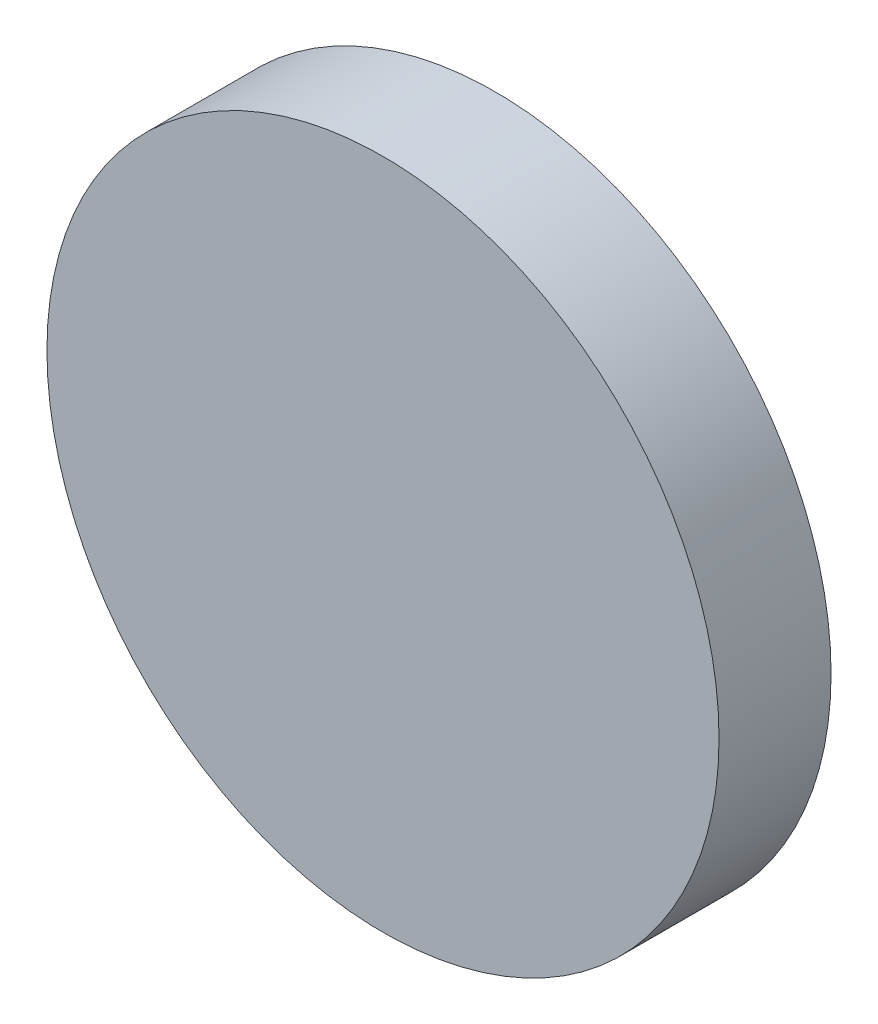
from build123d import *

# Parameters (mm, degrees)
ESQUISSE1_R          = 12
BASE_EXTRUSION_DEPTH = 4


with BuildPart() as part:
    # Esquisse1 → Base-Extrusion (new body)
    with BuildSketch(Plane.XY):
        Circle(ESQUISSE1_R)
    extrude(amount=BASE_EXTRUSION_DEPTH)


solid = part.part
